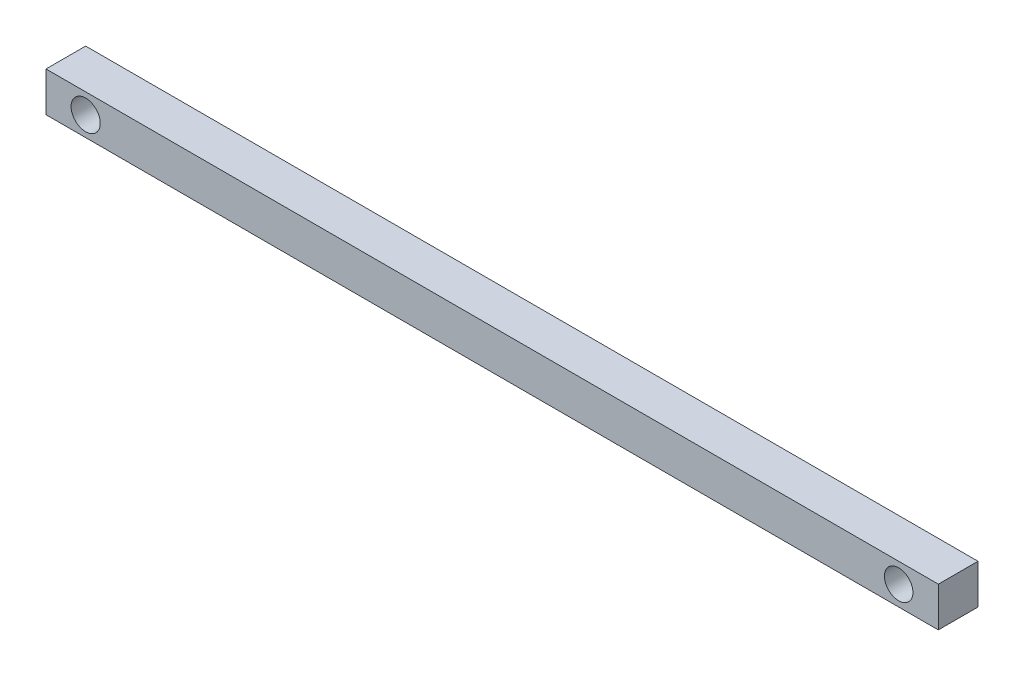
ISO-10303-21;
HEADER;
FILE_DESCRIPTION(('STEP AP214'),'2;1');
FILE_NAME('part.step','',(''),(''),'','','');
FILE_SCHEMA(('AUTOMOTIVE_DESIGN { 1 0 10303 214 1 1 1 1 }'));
ENDSEC;
DATA;
#1=APPLICATION_CONTEXT('core data for automotive mechanical design processes');
#2=APPLICATION_PROTOCOL_DEFINITION('international standard','automotive_design',2000,#1);
#3=PRODUCT_CONTEXT('',#1,'mechanical');
#4=PRODUCT('Part','Part','',(#3));
#5=PRODUCT_RELATED_PRODUCT_CATEGORY('part','',(#4));
#6=PRODUCT_DEFINITION_FORMATION('','',#4);
#7=PRODUCT_DEFINITION_CONTEXT('part definition',#1,'design');
#8=PRODUCT_DEFINITION('design','',#6,#7);
#9=PRODUCT_DEFINITION_SHAPE('','',#8);
#10=(LENGTH_UNIT() NAMED_UNIT(*) SI_UNIT(.MILLI.,.METRE.));
#11=(NAMED_UNIT(*) PLANE_ANGLE_UNIT() SI_UNIT($,.RADIAN.));
#12=(NAMED_UNIT(*) SI_UNIT($,.STERADIAN.) SOLID_ANGLE_UNIT());
#13=UNCERTAINTY_MEASURE_WITH_UNIT(LENGTH_MEASURE(1.E-05),#10,'distance_accuracy_value','');
#14=(GEOMETRIC_REPRESENTATION_CONTEXT(3) GLOBAL_UNCERTAINTY_ASSIGNED_CONTEXT((#13)) GLOBAL_UNIT_ASSIGNED_CONTEXT((#10,
#11,#12)) REPRESENTATION_CONTEXT('',''));
#15=CARTESIAN_POINT('',(0.,0.,0.));
#16=DIRECTION('',(0.,0.,1.));
#17=DIRECTION('',(1.,0.,0.));
#18=AXIS2_PLACEMENT_3D('',#15,#16,#17);
#19=CARTESIAN_POINT('',(-34.4412742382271,-1.2314404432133,20.));
#20=DIRECTION('',(0.,0.,1.));
#21=DIRECTION('',(1.,0.,0.));
#22=AXIS2_PLACEMENT_3D('',#19,#20,#21);
#23=PLANE('',#22);
#24=CARTESIAN_POINT('',(-14.4412742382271,8.70706371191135,20.));
#25=DIRECTION('',(0.,0.,1.));
#26=DIRECTION('',(1.,0.,0.));
#27=AXIS2_PLACEMENT_3D('',#24,#25,#26);
#28=CIRCLE('',#27,7.35263157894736);
#29=CARTESIAN_POINT('',(-7.08864265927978,8.70706371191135,20.));
#30=VERTEX_POINT('',#29);
#31=EDGE_CURVE('E407',#30,#30,#28,.T.);
#32=ORIENTED_EDGE('',*,*,#31,.F.);
#33=EDGE_LOOP('',(#32));
#34=FACE_BOUND('',#33,.T.);
#35=DIRECTION('',(0.,-1.,0.));
#36=VECTOR('',#35,1.);
#37=CARTESIAN_POINT('',(-34.4412742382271,18.7685595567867,20.));
#38=LINE('',#37,#36);
#39=CARTESIAN_POINT('',(-34.4412742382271,18.7685595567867,20.));
#40=VERTEX_POINT('',#39);
#41=CARTESIAN_POINT('',(-34.4412742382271,-1.2314404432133,20.));
#42=VERTEX_POINT('',#41);
#43=EDGE_CURVE('E417',#40,#42,#38,.T.);
#44=ORIENTED_EDGE('',*,*,#43,.T.);
#45=DIRECTION('',(1.,0.,0.));
#46=VECTOR('',#45,1.);
#47=CARTESIAN_POINT('',(-34.4412742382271,-1.2314404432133,20.));
#48=LINE('',#47,#46);
#49=CARTESIAN_POINT('',(415.558725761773,-1.2314404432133,20.));
#50=VERTEX_POINT('',#49);
#51=EDGE_CURVE('E402',#42,#50,#48,.T.);
#52=ORIENTED_EDGE('',*,*,#51,.T.);
#53=DIRECTION('',(0.,1.,0.));
#54=VECTOR('',#53,1.);
#55=CARTESIAN_POINT('',(415.558725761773,18.7685595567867,20.));
#56=LINE('',#55,#54);
#57=CARTESIAN_POINT('',(415.558725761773,18.7685595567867,20.));
#58=VERTEX_POINT('',#57);
#59=EDGE_CURVE('E368',#50,#58,#56,.T.);
#60=ORIENTED_EDGE('',*,*,#59,.T.);
#61=DIRECTION('',(-1.,0.,0.));
#62=VECTOR('',#61,1.);
#63=CARTESIAN_POINT('',(-34.4412742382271,18.7685595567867,20.));
#64=LINE('',#63,#62);
#65=EDGE_CURVE('E363',#58,#40,#64,.T.);
#66=ORIENTED_EDGE('',*,*,#65,.T.);
#67=EDGE_LOOP('',(#44,#52,#60,#66));
#68=FACE_BOUND('',#67,.T.);
#69=CARTESIAN_POINT('',(395.558725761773,8.70706371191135,20.));
#70=DIRECTION('',(0.,0.,1.));
#71=DIRECTION('',(1.,0.,0.));
#72=AXIS2_PLACEMENT_3D('',#69,#70,#71);
#73=CIRCLE('',#72,7.19712393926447);
#74=CARTESIAN_POINT('',(402.755849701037,8.70706371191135,20.));
#75=VERTEX_POINT('',#74);
#76=EDGE_CURVE('E435',#75,#75,#73,.T.);
#77=ORIENTED_EDGE('',*,*,#76,.F.);
#78=EDGE_LOOP('',(#77));
#79=FACE_BOUND('',#78,.T.);
#80=ADVANCED_FACE('F348',(#34,#68,#79),#23,.T.);
#81=CARTESIAN_POINT('',(-34.4412742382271,-1.2314404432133,0.));
#82=DIRECTION('',(0.,0.,1.));
#83=DIRECTION('',(1.,0.,0.));
#84=AXIS2_PLACEMENT_3D('',#81,#82,#83);
#85=PLANE('',#84);
#86=CARTESIAN_POINT('',(-14.4412742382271,8.70706371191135,0.));
#87=DIRECTION('',(0.,0.,1.));
#88=DIRECTION('',(1.,0.,0.));
#89=AXIS2_PLACEMENT_3D('',#86,#87,#88);
#90=CIRCLE('',#89,7.35263157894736);
#91=CARTESIAN_POINT('',(-7.08864265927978,8.70706371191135,0.));
#92=VERTEX_POINT('',#91);
#93=EDGE_CURVE('E410',#92,#92,#90,.T.);
#94=ORIENTED_EDGE('',*,*,#93,.T.);
#95=EDGE_LOOP('',(#94));
#96=FACE_BOUND('',#95,.T.);
#97=DIRECTION('',(0.,-1.,0.));
#98=VECTOR('',#97,1.);
#99=CARTESIAN_POINT('',(-34.4412742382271,18.7685595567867,0.));
#100=LINE('',#99,#98);
#101=CARTESIAN_POINT('',(-34.4412742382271,18.7685595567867,0.));
#102=VERTEX_POINT('',#101);
#103=CARTESIAN_POINT('',(-34.4412742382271,-1.2314404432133,0.));
#104=VERTEX_POINT('',#103);
#105=EDGE_CURVE('E394',#102,#104,#100,.T.);
#106=ORIENTED_EDGE('',*,*,#105,.F.);
#107=DIRECTION('',(-1.,0.,0.));
#108=VECTOR('',#107,1.);
#109=CARTESIAN_POINT('',(-34.4412742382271,18.7685595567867,0.));
#110=LINE('',#109,#108);
#111=CARTESIAN_POINT('',(415.558725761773,18.7685595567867,0.));
#112=VERTEX_POINT('',#111);
#113=EDGE_CURVE('E415',#112,#102,#110,.T.);
#114=ORIENTED_EDGE('',*,*,#113,.F.);
#115=DIRECTION('',(0.,1.,0.));
#116=VECTOR('',#115,1.);
#117=CARTESIAN_POINT('',(415.558725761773,18.7685595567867,0.));
#118=LINE('',#117,#116);
#119=CARTESIAN_POINT('',(415.558725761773,-1.2314404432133,0.));
#120=VERTEX_POINT('',#119);
#121=EDGE_CURVE('E395',#120,#112,#118,.T.);
#122=ORIENTED_EDGE('',*,*,#121,.F.);
#123=DIRECTION('',(1.,0.,0.));
#124=VECTOR('',#123,1.);
#125=CARTESIAN_POINT('',(-34.4412742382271,-1.2314404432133,0.));
#126=LINE('',#125,#124);
#127=EDGE_CURVE('E389',#104,#120,#126,.T.);
#128=ORIENTED_EDGE('',*,*,#127,.F.);
#129=EDGE_LOOP('',(#106,#114,#122,#128));
#130=FACE_BOUND('',#129,.T.);
#131=CARTESIAN_POINT('',(395.558725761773,8.70706371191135,0.));
#132=DIRECTION('',(0.,0.,1.));
#133=DIRECTION('',(1.,0.,0.));
#134=AXIS2_PLACEMENT_3D('',#131,#132,#133);
#135=CIRCLE('',#134,7.19712393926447);
#136=CARTESIAN_POINT('',(402.755849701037,8.70706371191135,0.));
#137=VERTEX_POINT('',#136);
#138=EDGE_CURVE('E437',#137,#137,#135,.T.);
#139=ORIENTED_EDGE('',*,*,#138,.T.);
#140=EDGE_LOOP('',(#139));
#141=FACE_BOUND('',#140,.T.);
#142=ADVANCED_FACE('F390',(#96,#130,#141),#85,.F.);
#143=CARTESIAN_POINT('',(-34.4412742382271,18.7685595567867,20.));
#144=DIRECTION('',(1.,0.,0.));
#145=DIRECTION('',(0.,0.,-1.));
#146=AXIS2_PLACEMENT_3D('',#143,#144,#145);
#147=PLANE('',#146);
#148=ORIENTED_EDGE('',*,*,#105,.T.);
#149=DIRECTION('',(0.,0.,-1.));
#150=VECTOR('',#149,1.);
#151=CARTESIAN_POINT('',(-34.4412742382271,-1.2314404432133,20.));
#152=LINE('',#151,#150);
#153=EDGE_CURVE('E11',#42,#104,#152,.T.);
#154=ORIENTED_EDGE('',*,*,#153,.F.);
#155=ORIENTED_EDGE('',*,*,#43,.F.);
#156=DIRECTION('',(0.,0.,-1.));
#157=VECTOR('',#156,1.);
#158=CARTESIAN_POINT('',(-34.4412742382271,18.7685595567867,20.));
#159=LINE('',#158,#157);
#160=EDGE_CURVE('E406',#40,#102,#159,.T.);
#161=ORIENTED_EDGE('',*,*,#160,.T.);
#162=EDGE_LOOP('',(#148,#154,#155,#161));
#163=FACE_BOUND('',#162,.T.);
#164=ADVANCED_FACE('F350',(#163),#147,.F.);
#165=CARTESIAN_POINT('',(-34.4412742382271,-1.2314404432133,20.));
#166=DIRECTION('',(0.,1.,0.));
#167=DIRECTION('',(0.,0.,1.));
#168=AXIS2_PLACEMENT_3D('',#165,#166,#167);
#169=PLANE('',#168);
#170=ORIENTED_EDGE('',*,*,#127,.T.);
#171=DIRECTION('',(0.,0.,-1.));
#172=VECTOR('',#171,1.);
#173=CARTESIAN_POINT('',(415.558725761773,-1.2314404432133,20.));
#174=LINE('',#173,#172);
#175=EDGE_CURVE('E356',#50,#120,#174,.T.);
#176=ORIENTED_EDGE('',*,*,#175,.F.);
#177=ORIENTED_EDGE('',*,*,#51,.F.);
#178=ORIENTED_EDGE('',*,*,#153,.T.);
#179=EDGE_LOOP('',(#170,#176,#177,#178));
#180=FACE_BOUND('',#179,.T.);
#181=ADVANCED_FACE('F401',(#180),#169,.F.);
#182=CARTESIAN_POINT('',(415.558725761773,18.7685595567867,20.));
#183=DIRECTION('',(-1.,0.,0.));
#184=DIRECTION('',(0.,0.,1.));
#185=AXIS2_PLACEMENT_3D('',#182,#183,#184);
#186=PLANE('',#185);
#187=ORIENTED_EDGE('',*,*,#121,.T.);
#188=DIRECTION('',(0.,0.,-1.));
#189=VECTOR('',#188,1.);
#190=CARTESIAN_POINT('',(415.558725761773,18.7685595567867,20.));
#191=LINE('',#190,#189);
#192=EDGE_CURVE('E423',#58,#112,#191,.T.);
#193=ORIENTED_EDGE('',*,*,#192,.F.);
#194=ORIENTED_EDGE('',*,*,#59,.F.);
#195=ORIENTED_EDGE('',*,*,#175,.T.);
#196=EDGE_LOOP('',(#187,#193,#194,#195));
#197=FACE_BOUND('',#196,.T.);
#198=ADVANCED_FACE('F426',(#197),#186,.F.);
#199=CARTESIAN_POINT('',(-34.4412742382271,18.7685595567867,20.));
#200=DIRECTION('',(0.,-1.,0.));
#201=DIRECTION('',(0.,0.,-1.));
#202=AXIS2_PLACEMENT_3D('',#199,#200,#201);
#203=PLANE('',#202);
#204=ORIENTED_EDGE('',*,*,#113,.T.);
#205=ORIENTED_EDGE('',*,*,#160,.F.);
#206=ORIENTED_EDGE('',*,*,#65,.F.);
#207=ORIENTED_EDGE('',*,*,#192,.T.);
#208=EDGE_LOOP('',(#204,#205,#206,#207));
#209=FACE_BOUND('',#208,.T.);
#210=ADVANCED_FACE('F428',(#209),#203,.F.);
#211=CARTESIAN_POINT('',(-14.4412742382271,8.70706371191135,20.));
#212=DIRECTION('',(0.,0.,-1.));
#213=DIRECTION('',(-1.,0.,0.));
#214=AXIS2_PLACEMENT_3D('',#211,#212,#213);
#215=CYLINDRICAL_SURFACE('',#214,7.35263157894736);
#216=ORIENTED_EDGE('',*,*,#31,.T.);
#217=EDGE_LOOP('',(#216));
#218=FACE_BOUND('',#217,.T.);
#219=ORIENTED_EDGE('',*,*,#93,.F.);
#220=EDGE_LOOP('',(#219));
#221=FACE_BOUND('',#220,.T.);
#222=ADVANCED_FACE('F446',(#218,#221),#215,.F.);
#223=CARTESIAN_POINT('',(395.558725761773,8.70706371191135,20.));
#224=DIRECTION('',(0.,0.,-1.));
#225=DIRECTION('',(-1.,0.,0.));
#226=AXIS2_PLACEMENT_3D('',#223,#224,#225);
#227=CYLINDRICAL_SURFACE('',#226,7.19712393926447);
#228=ORIENTED_EDGE('',*,*,#76,.T.);
#229=EDGE_LOOP('',(#228));
#230=FACE_BOUND('',#229,.T.);
#231=ORIENTED_EDGE('',*,*,#138,.F.);
#232=EDGE_LOOP('',(#231));
#233=FACE_BOUND('',#232,.T.);
#234=ADVANCED_FACE('F444',(#230,#233),#227,.F.);
#235=CLOSED_SHELL('',(#80,#142,#164,#181,#198,#210,#222,#234));
#236=MANIFOLD_SOLID_BREP('B2',#235);
#237=ADVANCED_BREP_SHAPE_REPRESENTATION('',(#18,#236),#14);
#238=SHAPE_DEFINITION_REPRESENTATION(#9,#237);
ENDSEC;
END-ISO-10303-21;
